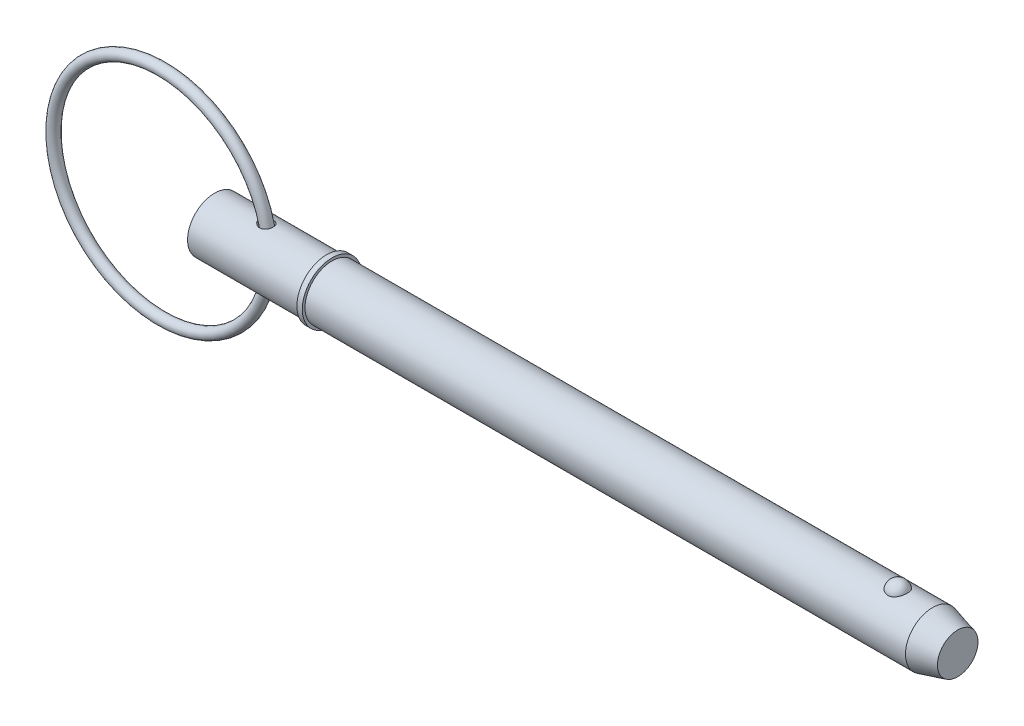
ISO-10303-21;
HEADER;
FILE_DESCRIPTION(('STEP AP214'),'2;1');
FILE_NAME('part.step','',(''),(''),'','','');
FILE_SCHEMA(('AUTOMOTIVE_DESIGN { 1 0 10303 214 1 1 1 1 }'));
ENDSEC;
DATA;
#1=APPLICATION_CONTEXT('core data for automotive mechanical design processes');
#2=APPLICATION_PROTOCOL_DEFINITION('international standard','automotive_design',2000,#1);
#3=PRODUCT_CONTEXT('',#1,'mechanical');
#4=PRODUCT('Part','Part','',(#3));
#5=PRODUCT_RELATED_PRODUCT_CATEGORY('part','',(#4));
#6=PRODUCT_DEFINITION_FORMATION('','',#4);
#7=PRODUCT_DEFINITION_CONTEXT('part definition',#1,'design');
#8=PRODUCT_DEFINITION('design','',#6,#7);
#9=PRODUCT_DEFINITION_SHAPE('','',#8);
#10=(LENGTH_UNIT() NAMED_UNIT(*) SI_UNIT(.MILLI.,.METRE.));
#11=(NAMED_UNIT(*) PLANE_ANGLE_UNIT() SI_UNIT($,.RADIAN.));
#12=(NAMED_UNIT(*) SI_UNIT($,.STERADIAN.) SOLID_ANGLE_UNIT());
#13=UNCERTAINTY_MEASURE_WITH_UNIT(LENGTH_MEASURE(1.E-05),#10,'distance_accuracy_value','');
#14=(GEOMETRIC_REPRESENTATION_CONTEXT(3) GLOBAL_UNCERTAINTY_ASSIGNED_CONTEXT((#13)) GLOBAL_UNIT_ASSIGNED_CONTEXT((#10,
#11,#12)) REPRESENTATION_CONTEXT('',''));
#15=CARTESIAN_POINT('',(0.,0.,0.));
#16=DIRECTION('',(0.,0.,1.));
#17=DIRECTION('',(1.,0.,0.));
#18=AXIS2_PLACEMENT_3D('',#15,#16,#17);
#19=CARTESIAN_POINT('',(-10.8860601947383,0.,0.));
#20=DIRECTION('',(0.,0.,1.));
#21=DIRECTION('',(1.,0.,0.));
#22=AXIS2_PLACEMENT_3D('',#19,#20,#21);
#23=TOROIDAL_SURFACE('',#22,22.225,1.111);
#24=CARTESIAN_POINT('',(12.4499398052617,0.,0.));
#25=VERTEX_POINT('',#24);
#26=VERTEX_LOOP('',#25);
#27=FACE_BOUND('',#26,.T.);
#28=ADVANCED_FACE('P0_F12',(#27),#23,.T.);
#29=CLOSED_SHELL('',(#28));
#30=MANIFOLD_SOLID_BREP('P0_B1',#29);
#31=CARTESIAN_POINT('',(0.,0.,0.));
#32=DIRECTION('',(1.,0.,0.));
#33=DIRECTION('',(0.,0.,-1.));
#34=AXIS2_PLACEMENT_3D('',#31,#32,#33);
#35=CYLINDRICAL_SURFACE('',#34,5.555);
#36=CARTESIAN_POINT('',(9.73108588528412,5.4531967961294,-1.05861687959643));
#37=CARTESIAN_POINT('',(9.79852417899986,5.4428857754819,-1.11173367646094));
#38=CARTESIAN_POINT('',(9.8705426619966,5.43287373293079,-1.15917228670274));
#39=CARTESIAN_POINT('',(10.0216706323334,5.41463354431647,-1.24159548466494));
#40=CARTESIAN_POINT('',(10.100788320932,5.40640749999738,-1.27656543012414));
#41=CARTESIAN_POINT('',(10.2640671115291,5.39277501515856,-1.33298568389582));
#42=CARTESIAN_POINT('',(10.3482338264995,5.38737178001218,-1.35442062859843));
#43=CARTESIAN_POINT('',(10.5191189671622,5.38018930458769,-1.38268153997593));
#44=CARTESIAN_POINT('',(10.6058357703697,5.37840780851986,-1.38951660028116));
#45=CARTESIAN_POINT('',(10.7759121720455,5.37883071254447,-1.38787777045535));
#46=CARTESIAN_POINT('',(10.8592768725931,5.38088957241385,-1.37996287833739));
#47=CARTESIAN_POINT('',(11.0231742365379,5.38856355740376,-1.34968531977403));
#48=CARTESIAN_POINT('',(11.1037078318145,5.39417750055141,-1.3273274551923));
#49=CARTESIAN_POINT('',(11.2542656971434,5.40784427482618,-1.27044672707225));
#50=CARTESIAN_POINT('',(11.3246325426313,5.41571997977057,-1.23678468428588));
#51=CARTESIAN_POINT('',(11.4584043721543,5.43310849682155,-1.15800564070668));
#52=CARTESIAN_POINT('',(11.5218100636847,5.44262114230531,-1.11288980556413));
#53=CARTESIAN_POINT('',(11.6387006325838,5.4619946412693,-1.01348173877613));
#54=CARTESIAN_POINT('',(11.6923567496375,5.47184490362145,-0.959388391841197));
#55=CARTESIAN_POINT('',(11.7899079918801,5.49098914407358,-0.842935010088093));
#56=CARTESIAN_POINT('',(11.8338027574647,5.5002831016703,-0.780574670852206));
#57=CARTESIAN_POINT('',(11.9111930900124,5.51740919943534,-0.648605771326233));
#58=CARTESIAN_POINT('',(11.944571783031,5.52522454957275,-0.578926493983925));
#59=CARTESIAN_POINT('',(11.9994972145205,5.5384271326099,-0.434834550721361));
#60=CARTESIAN_POINT('',(12.0210434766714,5.54381426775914,-0.360421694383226));
#61=CARTESIAN_POINT('',(12.0519313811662,5.55161917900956,-0.208311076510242));
#62=CARTESIAN_POINT('',(12.0611710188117,5.55401212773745,-0.130591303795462));
#63=CARTESIAN_POINT('',(12.0668974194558,5.55548938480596,0.025348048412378));
#64=CARTESIAN_POINT('',(12.0633840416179,5.55457365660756,0.103567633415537));
#65=CARTESIAN_POINT('',(12.0436796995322,5.54953010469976,0.258343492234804));
#66=CARTESIAN_POINT('',(12.0274798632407,5.54540003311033,0.334898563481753));
#67=CARTESIAN_POINT('',(11.9827711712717,5.53437033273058,0.484118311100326));
#68=CARTESIAN_POINT('',(11.9542620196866,5.52747063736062,0.556782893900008));
#69=CARTESIAN_POINT('',(11.8856108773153,5.51165296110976,0.696153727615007));
#70=CARTESIAN_POINT('',(11.8454690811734,5.50273501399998,0.762860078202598));
#71=CARTESIAN_POINT('',(11.7545317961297,5.48386724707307,0.888403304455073));
#72=CARTESIAN_POINT('',(11.7037367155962,5.47391746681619,0.94724048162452));
#73=CARTESIAN_POINT('',(11.5931044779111,5.45416351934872,1.05504470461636));
#74=CARTESIAN_POINT('',(11.533318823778,5.44435885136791,1.10406448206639));
#75=CARTESIAN_POINT('',(11.4061321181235,5.42595363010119,1.19123649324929));
#76=CARTESIAN_POINT('',(11.3387321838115,5.41735290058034,1.22939031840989));
#77=CARTESIAN_POINT('',(11.1991395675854,5.4024225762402,1.29341737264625));
#78=CARTESIAN_POINT('',(11.1270175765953,5.3960658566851,1.3194385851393));
#79=CARTESIAN_POINT('',(10.979323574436,5.38614405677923,1.35937634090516));
#80=CARTESIAN_POINT('',(10.9037515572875,5.38257898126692,1.37329286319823));
#81=CARTESIAN_POINT('',(10.7507722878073,5.37854282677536,1.38901730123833));
#82=CARTESIAN_POINT('',(10.6733560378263,5.37809300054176,1.39074204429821));
#83=CARTESIAN_POINT('',(10.5192388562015,5.38029043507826,1.38221411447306));
#84=CARTESIAN_POINT('',(10.4425381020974,5.38293844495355,1.37195854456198));
#85=CARTESIAN_POINT('',(10.2878936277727,5.39116673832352,1.33926960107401));
#86=CARTESIAN_POINT('',(10.2100819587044,5.3968880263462,1.31624874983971));
#87=CARTESIAN_POINT('',(10.0591420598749,5.4106466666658,1.25849276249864));
#88=CARTESIAN_POINT('',(9.98601576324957,5.41868496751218,1.22375282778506));
#89=CARTESIAN_POINT('',(9.84175565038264,5.43675805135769,1.14087469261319));
#90=CARTESIAN_POINT('',(9.77103801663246,5.44688674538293,1.09202994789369));
#91=CARTESIAN_POINT('',(9.63888287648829,5.46759592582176,0.983100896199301));
#92=CARTESIAN_POINT('',(9.57744762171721,5.47817652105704,0.923013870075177));
#93=CARTESIAN_POINT('',(9.4662044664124,5.49850106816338,0.792984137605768));
#94=CARTESIAN_POINT('',(9.4163677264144,5.5082470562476,0.723066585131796));
#95=CARTESIAN_POINT('',(9.33050546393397,5.52566389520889,0.574973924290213));
#96=CARTESIAN_POINT('',(9.29446727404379,5.53333664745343,0.496806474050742));
#97=CARTESIAN_POINT('',(9.24109888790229,5.54491199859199,0.342579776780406));
#98=CARTESIAN_POINT('',(9.22228936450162,5.54910883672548,0.26705568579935));
#99=CARTESIAN_POINT('',(9.19883437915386,5.55436306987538,0.113748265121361));
#100=CARTESIAN_POINT('',(9.19417820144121,5.55542284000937,0.0359666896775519));
#101=CARTESIAN_POINT('',(9.19905385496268,5.55432298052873,-0.111477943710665));
#102=CARTESIAN_POINT('',(9.20724428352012,5.55246769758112,-0.181191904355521));
#103=CARTESIAN_POINT('',(9.23493000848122,5.54630180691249,-0.318223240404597));
#104=CARTESIAN_POINT('',(9.25442702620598,5.54199082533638,-0.385540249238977));
#105=CARTESIAN_POINT('',(9.30387481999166,5.5313474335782,-0.516280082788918));
#106=CARTESIAN_POINT('',(9.33386163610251,5.52500806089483,-0.579688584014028));
#107=CARTESIAN_POINT('',(9.40305503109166,5.51092599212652,-0.701037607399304));
#108=CARTESIAN_POINT('',(9.44225922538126,5.50318365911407,-0.758979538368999));
#109=CARTESIAN_POINT('',(9.52133732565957,5.48833949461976,-0.859230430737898));
#110=CARTESIAN_POINT('',(9.55998996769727,5.48134889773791,-0.902529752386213));
#111=CARTESIAN_POINT('',(9.64209346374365,5.46725903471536,-0.984288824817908));
#112=CARTESIAN_POINT('',(9.68554534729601,5.46015974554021,-1.02274753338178));
#113=CARTESIAN_POINT('',(9.73108588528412,5.4531967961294,-1.05861687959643));
#114=B_SPLINE_CURVE_WITH_KNOTS('',3,(#36,#37,#38,#39,#40,#41,#42,#43,#44,#45,#46,#47,#48,#49,
#50,#51,#52,#53,#54,#55,#56,#57,#58,#59,#60,#61,#62,#63,#64,#65,#66,#67,#68,#69,#70,#71,#72,#73,
#74,#75,#76,#77,#78,#79,#80,#81,#82,#83,#84,#85,#86,#87,#88,#89,#90,#91,#92,#93,#94,#95,#96,#97,
#98,#99,#100,#101,#102,#103,#104,#105,#106,#107,#108,#109,#110,#111,#112,#113),.UNSPECIFIED.,
.T.,.F.,(4,2,2,2,2,2,2,2,2,2,2,2,2,2,2,2,2,2,2,2,2,2,2,2,2,2,2,2,2,2,2,2,2,2,2,2,2,2,4),(0.,
0.259176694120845,0.518656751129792,0.778430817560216,1.03804303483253,1.28801585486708,
1.53790560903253,1.77195750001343,2.00598558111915,2.23539047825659,2.4648038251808,
2.69668356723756,2.9285726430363,3.16237203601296,3.39617401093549,3.63013963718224,
3.86411088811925,4.09807822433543,4.33203659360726,4.56470246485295,4.79733424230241,
5.02704913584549,5.25676442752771,5.48804534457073,5.71938220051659,5.96237360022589,
6.20546461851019,6.46387943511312,6.72235683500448,6.98018450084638,7.23777490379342,
7.4702968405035,7.70264268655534,7.91229396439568,8.12197716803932,8.33238797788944,
8.54274441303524,8.71772674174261,8.89274668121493),.UNSPECIFIED.);
#115=CARTESIAN_POINT('',(9.73108588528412,5.4531967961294,-1.05861687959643));
#116=VERTEX_POINT('',#115);
#117=EDGE_CURVE('P1_E42',#116,#116,#114,.T.);
#118=ORIENTED_EDGE('',*,*,#117,.T.);
#119=EDGE_LOOP('',(#118));
#120=FACE_BOUND('',#119,.T.);
#121=CARTESIAN_POINT('',(0.,0.,0.));
#122=DIRECTION('',(1.,0.,0.));
#123=DIRECTION('',(0.,0.,-1.));
#124=AXIS2_PLACEMENT_3D('',#121,#122,#123);
#125=CIRCLE('',#124,5.555);
#126=CARTESIAN_POINT('',(0.,0.,-5.555));
#127=VERTEX_POINT('',#126);
#128=EDGE_CURVE('P1_E9',#127,#127,#125,.T.);
#129=ORIENTED_EDGE('',*,*,#128,.T.);
#130=EDGE_LOOP('',(#129));
#131=FACE_BOUND('',#130,.T.);
#132=CARTESIAN_POINT('',(23.019,0.,0.));
#133=DIRECTION('',(1.,0.,0.));
#134=DIRECTION('',(0.,0.,-1.));
#135=AXIS2_PLACEMENT_3D('',#132,#133,#134);
#136=CIRCLE('',#135,5.555);
#137=CARTESIAN_POINT('',(23.019,0.,-5.555));
#138=VERTEX_POINT('',#137);
#139=EDGE_CURVE('P1_E25',#138,#138,#136,.T.);
#140=ORIENTED_EDGE('',*,*,#139,.F.);
#141=EDGE_LOOP('',(#140));
#142=FACE_BOUND('',#141,.T.);
#143=CARTESIAN_POINT('',(9.73108588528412,-5.4531967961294,-1.05861687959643));
#144=CARTESIAN_POINT('',(9.66821110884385,-5.46281068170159,-1.00909184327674));
#145=CARTESIAN_POINT('',(9.60927221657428,-5.47269103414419,-0.954597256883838));
#146=CARTESIAN_POINT('',(9.50103698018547,-5.49196271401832,-0.836622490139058));
#147=CARTESIAN_POINT('',(9.45174193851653,-5.50135397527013,-0.773141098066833));
#148=CARTESIAN_POINT('',(9.36449982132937,-5.51864538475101,-0.638139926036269));
#149=CARTESIAN_POINT('',(9.32660692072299,-5.52653835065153,-0.566583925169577));
#150=CARTESIAN_POINT('',(9.26443740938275,-5.53978685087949,-0.417563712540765));
#151=CARTESIAN_POINT('',(9.24015003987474,-5.54514438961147,-0.34010422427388));
#152=CARTESIAN_POINT('',(9.20806696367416,-5.55228040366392,-0.188389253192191));
#153=CARTESIAN_POINT('',(9.19907227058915,-5.55431849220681,-0.114399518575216));
#154=CARTESIAN_POINT('',(9.19432225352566,-5.55539069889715,0.0340148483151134));
#155=CARTESIAN_POINT('',(9.19856204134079,-5.55442592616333,0.108439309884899));
#156=CARTESIAN_POINT('',(9.21926816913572,-5.54978420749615,0.250226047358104));
#157=CARTESIAN_POINT('',(9.2348766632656,-5.54629766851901,0.31772275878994));
#158=CARTESIAN_POINT('',(9.27656619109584,-5.53719805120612,0.449233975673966));
#159=CARTESIAN_POINT('',(9.3026486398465,-5.53158468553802,0.513248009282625));
#160=CARTESIAN_POINT('',(9.36540111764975,-5.51852259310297,0.63880901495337));
#161=CARTESIAN_POINT('',(9.40244578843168,-5.51101059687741,0.700161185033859));
#162=CARTESIAN_POINT('',(9.48531033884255,-5.49498546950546,0.816463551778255));
#163=CARTESIAN_POINT('',(9.5311337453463,-5.48647193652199,0.871411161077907));
#164=CARTESIAN_POINT('',(9.63549825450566,-5.46826315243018,0.979510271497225));
#165=CARTESIAN_POINT('',(9.69487291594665,-5.4585383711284,1.03185240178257));
#166=CARTESIAN_POINT('',(9.82107706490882,-5.43973797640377,1.12677509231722));
#167=CARTESIAN_POINT('',(9.8879103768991,-5.43066269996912,1.16935061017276));
#168=CARTESIAN_POINT('',(10.033391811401,-5.41336505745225,1.24708757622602));
#169=CARTESIAN_POINT('',(10.1125613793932,-5.40528106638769,1.28130933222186));
#170=CARTESIAN_POINT('',(10.2757060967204,-5.39196874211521,1.3362270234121));
#171=CARTESIAN_POINT('',(10.3596813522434,-5.38674047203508,1.35692265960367));
#172=CARTESIAN_POINT('',(10.5297702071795,-5.37991196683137,1.38375156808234));
#173=CARTESIAN_POINT('',(10.6158742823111,-5.37829778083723,1.38994084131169));
#174=CARTESIAN_POINT('',(10.7878226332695,-5.37901070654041,1.38718250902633));
#175=CARTESIAN_POINT('',(10.8736670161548,-5.38133587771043,1.37824235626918));
#176=CARTESIAN_POINT('',(11.0366214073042,-5.38945418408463,1.34612618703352));
#177=CARTESIAN_POINT('',(11.1139351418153,-5.39501006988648,1.32392147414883));
#178=CARTESIAN_POINT('',(11.2633246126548,-5.40877222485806,1.26652021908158));
#179=CARTESIAN_POINT('',(11.3354015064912,-5.41697790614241,1.23132655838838));
#180=CARTESIAN_POINT('',(11.4690899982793,-5.43466078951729,1.15069817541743));
#181=CARTESIAN_POINT('',(11.5310200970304,-5.4440673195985,1.10577441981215));
#182=CARTESIAN_POINT('',(11.6463540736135,-5.46335537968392,1.0061512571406));
#183=CARTESIAN_POINT('',(11.6997580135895,-5.47323690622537,0.951451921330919));
#184=CARTESIAN_POINT('',(11.7967319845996,-5.49239864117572,0.833747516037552));
#185=CARTESIAN_POINT('',(11.8402908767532,-5.50167816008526,0.770733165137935));
#186=CARTESIAN_POINT('',(11.9164538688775,-5.518621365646,0.638202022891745));
#187=CARTESIAN_POINT('',(11.9490573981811,-5.52628496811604,0.568684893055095));
#188=CARTESIAN_POINT('',(12.0028717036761,-5.53925911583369,0.424207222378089));
#189=CARTESIAN_POINT('',(12.023941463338,-5.54454040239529,0.349191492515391));
#190=CARTESIAN_POINT('',(12.053591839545,-5.55204602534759,0.196582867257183));
#191=CARTESIAN_POINT('',(12.0621722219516,-5.55427030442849,0.118989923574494));
#192=CARTESIAN_POINT('',(12.0666512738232,-5.55542602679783,-0.0368468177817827));
#193=CARTESIAN_POINT('',(12.0625074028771,-5.55434642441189,-0.11509192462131));
#194=CARTESIAN_POINT('',(12.0415418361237,-5.54898613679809,-0.269753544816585));
#195=CARTESIAN_POINT('',(12.0247199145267,-5.54470539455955,-0.346170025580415));
#196=CARTESIAN_POINT('',(11.9787920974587,-5.53340452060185,-0.495008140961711));
#197=CARTESIAN_POINT('',(11.9496857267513,-5.52638428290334,-0.56742962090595));
#198=CARTESIAN_POINT('',(11.8798787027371,-5.51036911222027,-0.706216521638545));
#199=CARTESIAN_POINT('',(11.8391779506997,-5.50137416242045,-0.772581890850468));
#200=CARTESIAN_POINT('',(11.7472553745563,-5.48242167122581,-0.897247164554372));
#201=CARTESIAN_POINT('',(11.6960515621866,-5.47246579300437,-0.955560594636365));
#202=CARTESIAN_POINT('',(11.5843994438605,-5.45270071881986,-1.06256643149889));
#203=CARTESIAN_POINT('',(11.5239521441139,-5.44289150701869,-1.11125988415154));
#204=CARTESIAN_POINT('',(11.396157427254,-5.42463941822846,-1.19717500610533));
#205=CARTESIAN_POINT('',(11.3288903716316,-5.41618309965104,-1.23451335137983));
#206=CARTESIAN_POINT('',(11.1888557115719,-5.40145691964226,-1.29743539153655));
#207=CARTESIAN_POINT('',(11.1160887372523,-5.39518680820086,-1.32302043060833));
#208=CARTESIAN_POINT('',(10.9677009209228,-5.38553131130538,-1.36179181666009));
#209=CARTESIAN_POINT('',(10.8921036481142,-5.38212602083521,-1.3750637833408));
#210=CARTESIAN_POINT('',(10.7396925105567,-5.37842027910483,-1.38948741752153));
#211=CARTESIAN_POINT('',(10.6628784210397,-5.37812040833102,-1.39063681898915));
#212=CARTESIAN_POINT('',(10.5077947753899,-5.38059635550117,-1.38102577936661));
#213=CARTESIAN_POINT('',(10.4295489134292,-5.3834629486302,-1.36991384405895));
#214=CARTESIAN_POINT('',(10.2758428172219,-5.3920092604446,-1.33587599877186));
#215=CARTESIAN_POINT('',(10.2003829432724,-5.39768934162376,-1.31294856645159));
#216=CARTESIAN_POINT('',(10.0559381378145,-5.4110281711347,-1.25682313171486));
#217=CARTESIAN_POINT('',(9.98683368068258,-5.41862962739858,-1.22391777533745));
#218=CARTESIAN_POINT('',(9.85432617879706,-5.43513913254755,-1.14838146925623));
#219=CARTESIAN_POINT('',(9.79092361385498,-5.44404729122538,-1.1057497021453));
#220=CARTESIAN_POINT('',(9.73108588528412,-5.4531967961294,-1.05861687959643));
#221=B_SPLINE_CURVE_WITH_KNOTS('',3,(#143,#144,#145,#146,#147,#148,#149,#150,#151,#152,#153,
#154,#155,#156,#157,#158,#159,#160,#161,#162,#163,#164,#165,#166,#167,#168,#169,#170,#171,#172,
#173,#174,#175,#176,#177,#178,#179,#180,#181,#182,#183,#184,#185,#186,#187,#188,#189,#190,#191,
#192,#193,#194,#195,#196,#197,#198,#199,#200,#201,#202,#203,#204,#205,#206,#207,#208,#209,#210,
#211,#212,#213,#214,#215,#216,#217,#218,#219,#220),.UNSPECIFIED.,.T.,.F.,(4,2,2,2,2,2,2,2,2,2,2,
2,2,2,2,2,2,2,2,2,2,2,2,2,2,2,2,2,2,2,2,2,2,2,2,2,2,2,4),(0.,0.241596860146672,
0.483226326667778,0.725986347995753,0.968554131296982,1.19103755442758,1.41343881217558,
1.62059806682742,1.82778531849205,2.04308674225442,2.25847484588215,2.4967195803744,
2.73508704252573,2.99374644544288,3.25241156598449,3.51007646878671,3.76761448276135,
4.00827541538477,4.24888299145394,4.47904430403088,4.70920393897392,4.93962269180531,
5.17005344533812,5.4032419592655,5.63643484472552,5.87040820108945,6.10438572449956,
6.33837230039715,6.57236086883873,6.80595147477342,7.03951667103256,7.27059385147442,
7.50164459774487,7.73107640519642,7.96055109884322,8.19677907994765,8.43303750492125,
8.66294515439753,8.89287213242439),.UNSPECIFIED.);
#222=CARTESIAN_POINT('',(9.73108588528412,-5.4531967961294,-1.05861687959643));
#223=VERTEX_POINT('',#222);
#224=EDGE_CURVE('P1_E17',#223,#223,#221,.T.);
#225=ORIENTED_EDGE('',*,*,#224,.T.);
#226=EDGE_LOOP('',(#225));
#227=FACE_BOUND('',#226,.T.);
#228=ADVANCED_FACE('P1_F13',(#120,#131,#142,#227),#35,.T.);
#229=CARTESIAN_POINT('',(0.,0.,0.));
#230=DIRECTION('',(1.,0.,0.));
#231=DIRECTION('',(0.,0.,-1.));
#232=AXIS2_PLACEMENT_3D('',#229,#230,#231);
#233=CYLINDRICAL_SURFACE('',#232,5.555);
#234=CARTESIAN_POINT('',(147.517114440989,0.,0.));
#235=DIRECTION('',(1.,0.,0.));
#236=DIRECTION('',(0.,0.,-1.));
#237=AXIS2_PLACEMENT_3D('',#234,#235,#236);
#238=CIRCLE('',#237,5.555);
#239=CARTESIAN_POINT('',(147.517114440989,0.,-5.555));
#240=VERTEX_POINT('',#239);
#241=EDGE_CURVE('P1_E99',#240,#240,#238,.T.);
#242=ORIENTED_EDGE('',*,*,#241,.F.);
#243=EDGE_LOOP('',(#242));
#244=FACE_BOUND('',#243,.T.);
#245=CARTESIAN_POINT('',(24.13,0.,0.));
#246=DIRECTION('',(1.,0.,0.));
#247=DIRECTION('',(0.,0.,-1.));
#248=AXIS2_PLACEMENT_3D('',#245,#246,#247);
#249=CIRCLE('',#248,5.555);
#250=CARTESIAN_POINT('',(24.13,0.,-5.555));
#251=VERTEX_POINT('',#250);
#252=EDGE_CURVE('P1_E96',#251,#251,#249,.T.);
#253=ORIENTED_EDGE('',*,*,#252,.T.);
#254=EDGE_LOOP('',(#253));
#255=FACE_BOUND('',#254,.T.);
#256=CARTESIAN_POINT('',(140.398626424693,5.16741224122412,2.03859650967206));
#257=CARTESIAN_POINT('',(140.292949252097,5.16740893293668,2.03859990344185));
#258=CARTESIAN_POINT('',(140.18729894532,5.17079470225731,2.03008306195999));
#259=CARTESIAN_POINT('',(139.979141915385,5.18392795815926,1.99630721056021));
#260=CARTESIAN_POINT('',(139.876634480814,5.19367399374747,1.97105201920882));
#261=CARTESIAN_POINT('',(139.677771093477,5.21839168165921,1.90463997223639));
#262=CARTESIAN_POINT('',(139.581406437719,5.23335573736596,1.8635062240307));
#263=CARTESIAN_POINT('',(139.397080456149,5.26688076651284,1.76652592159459));
#264=CARTESIAN_POINT('',(139.309120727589,5.28544242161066,1.71067657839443));
#265=CARTESIAN_POINT('',(139.141265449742,5.32479845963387,1.58399959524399));
#266=CARTESIAN_POINT('',(139.06166564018,5.34564089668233,1.51279545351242));
#267=CARTESIAN_POINT('',(138.91512901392,5.38697258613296,1.35828584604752));
#268=CARTESIAN_POINT('',(138.848194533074,5.40746177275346,1.27497815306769));
#269=CARTESIAN_POINT('',(138.72561039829,5.44694508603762,1.0944029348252));
#270=CARTESIAN_POINT('',(138.670598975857,5.46583143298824,0.996677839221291));
#271=CARTESIAN_POINT('',(138.576937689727,5.49908030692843,0.792961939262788));
#272=CARTESIAN_POINT('',(138.538289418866,5.513442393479,0.686970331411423));
#273=CARTESIAN_POINT('',(138.477680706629,5.53635851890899,0.468019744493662));
#274=CARTESIAN_POINT('',(138.455972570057,5.54482455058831,0.354981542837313));
#275=CARTESIAN_POINT('',(138.430636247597,5.55473324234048,0.126595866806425));
#276=CARTESIAN_POINT('',(138.427007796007,5.55617600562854,0.0112484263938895));
#277=CARTESIAN_POINT('',(138.437881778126,5.55189984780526,-0.218011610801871));
#278=CARTESIAN_POINT('',(138.452315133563,5.54620821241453,-0.331928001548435));
#279=CARTESIAN_POINT('',(138.498903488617,5.52828920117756,-0.555544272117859));
#280=CARTESIAN_POINT('',(138.531058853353,5.5160616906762,-0.665244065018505));
#281=CARTESIAN_POINT('',(138.612488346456,5.48630779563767,-0.877469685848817));
#282=CARTESIAN_POINT('',(138.661781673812,5.4687754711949,-0.979987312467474));
#283=CARTESIAN_POINT('',(138.776478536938,5.43024700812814,-1.1748697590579));
#284=CARTESIAN_POINT('',(138.841883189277,5.4092506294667,-1.26723387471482));
#285=CARTESIAN_POINT('',(138.987571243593,5.36600927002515,-1.4394013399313));
#286=CARTESIAN_POINT('',(139.067885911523,5.34376173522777,-1.51917763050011));
#287=CARTESIAN_POINT('',(139.241452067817,5.30057971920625,-1.66360338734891));
#288=CARTESIAN_POINT('',(139.334702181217,5.27964509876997,-1.72825445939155));
#289=CARTESIAN_POINT('',(139.529393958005,5.24205250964,-1.83909478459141));
#290=CARTESIAN_POINT('',(139.630590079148,5.22530519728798,-1.88568407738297));
#291=CARTESIAN_POINT('',(139.840155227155,5.19750919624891,-1.96100802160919));
#292=CARTESIAN_POINT('',(139.948521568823,5.1864583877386,-1.98974931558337));
#293=CARTESIAN_POINT('',(140.163498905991,5.17184410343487,-2.02742262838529));
#294=CARTESIAN_POINT('',(140.269925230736,5.1679328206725,-2.03727608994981));
#295=CARTESIAN_POINT('',(140.482992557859,5.16698995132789,-2.03966777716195));
#296=CARTESIAN_POINT('',(140.589633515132,5.16995704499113,-2.0322093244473));
#297=CARTESIAN_POINT('',(140.796773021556,5.18222383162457,-2.00071170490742));
#298=CARTESIAN_POINT('',(140.897359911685,5.19133213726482,-1.97717337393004));
#299=CARTESIAN_POINT('',(141.093014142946,5.21467637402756,-1.91475248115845));
#300=CARTESIAN_POINT('',(141.188081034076,5.22891272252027,-1.87586867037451));
#301=CARTESIAN_POINT('',(141.372371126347,5.26137066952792,-1.78282713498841));
#302=CARTESIAN_POINT('',(141.461419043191,5.27967329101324,-1.72835124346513));
#303=CARTESIAN_POINT('',(141.629288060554,5.3181741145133,-1.60597483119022));
#304=CARTESIAN_POINT('',(141.708106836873,5.33837274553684,-1.5380712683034));
#305=CARTESIAN_POINT('',(141.857515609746,5.37968287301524,-1.38688970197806));
#306=CARTESIAN_POINT('',(141.927505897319,5.40079011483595,-1.3030174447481));
#307=CARTESIAN_POINT('',(142.053012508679,5.44074401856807,-1.12458170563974));
#308=CARTESIAN_POINT('',(142.108526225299,5.45959027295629,-1.03001630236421));
#309=CARTESIAN_POINT('',(142.205550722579,5.49369849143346,-0.829439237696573));
#310=CARTESIAN_POINT('',(142.246548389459,5.50882422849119,-0.723155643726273));
#311=CARTESIAN_POINT('',(142.311125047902,5.53310911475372,-0.50477271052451));
#312=CARTESIAN_POINT('',(142.334703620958,5.54226812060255,-0.392673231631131));
#313=CARTESIAN_POINT('',(142.364013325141,5.55370358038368,-0.165459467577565));
#314=CARTESIAN_POINT('',(142.369688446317,5.55595843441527,-0.0503368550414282));
#315=CARTESIAN_POINT('',(142.362916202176,5.55329317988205,0.179288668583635));
#316=CARTESIAN_POINT('',(142.350469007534,5.54837313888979,0.293791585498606));
#317=CARTESIAN_POINT('',(142.307779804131,5.53189037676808,0.518526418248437));
#318=CARTESIAN_POINT('',(142.277598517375,5.5203503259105,0.628771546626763));
#319=CARTESIAN_POINT('',(142.200096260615,5.49182453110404,0.842318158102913));
#320=CARTESIAN_POINT('',(142.152774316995,5.47483847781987,0.945619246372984));
#321=CARTESIAN_POINT('',(142.041720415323,5.43710633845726,1.14281571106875));
#322=CARTESIAN_POINT('',(141.977921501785,5.41634501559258,1.23667048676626));
#323=CARTESIAN_POINT('',(141.835357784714,5.37334572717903,1.41185243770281));
#324=CARTESIAN_POINT('',(141.75659323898,5.35110778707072,1.49317982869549));
#325=CARTESIAN_POINT('',(141.586423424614,5.30779474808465,1.64049162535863));
#326=CARTESIAN_POINT('',(141.49510026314,5.28671324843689,1.7065687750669));
#327=CARTESIAN_POINT('',(141.301739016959,5.2480485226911,1.82201372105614));
#328=CARTESIAN_POINT('',(141.199700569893,5.23046541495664,1.87138095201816));
#329=CARTESIAN_POINT('',(140.983618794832,5.20042692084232,1.95335298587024));
#330=CARTESIAN_POINT('',(140.869260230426,5.18820192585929,1.98521734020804));
#331=CARTESIAN_POINT('',(140.636130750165,5.17169804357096,2.02783294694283));
#332=CARTESIAN_POINT('',(140.517361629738,5.16741595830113,2.03859269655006));
#333=CARTESIAN_POINT('',(140.398626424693,5.16741224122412,2.03859650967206));
#334=B_SPLINE_CURVE_WITH_KNOTS('',3,(#256,#257,#258,#259,#260,#261,#262,#263,#264,#265,#266,
#267,#268,#269,#270,#271,#272,#273,#274,#275,#276,#277,#278,#279,#280,#281,#282,#283,#284,#285,
#286,#287,#288,#289,#290,#291,#292,#293,#294,#295,#296,#297,#298,#299,#300,#301,#302,#303,#304,
#305,#306,#307,#308,#309,#310,#311,#312,#313,#314,#315,#316,#317,#318,#319,#320,#321,#322,#323,
#324,#325,#326,#327,#328,#329,#330,#331,#332,#333),.UNSPECIFIED.,.T.,.F.,(4,2,2,2,2,2,2,2,2,2,2,
2,2,2,2,2,2,2,2,2,2,2,2,2,2,2,2,2,2,2,2,2,2,2,2,2,2,2,4),(0.,0.316595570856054,
0.633118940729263,0.949183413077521,1.26530783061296,1.59030762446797,1.91536729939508,
2.25495824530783,2.59458224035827,2.93917283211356,3.28375835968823,3.62703002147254,
3.97030875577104,4.31397329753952,4.65766166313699,5.00207904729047,5.34645984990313,
5.68270547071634,6.01882587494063,6.33808403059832,6.65728093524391,6.9669637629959,
7.27667180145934,7.59321535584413,7.90983070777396,8.24210387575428,8.57443684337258,
8.91755896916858,9.26068933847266,9.604892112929,9.94909164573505,10.2921194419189,
10.6351667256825,10.9796305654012,11.3240884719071,11.6663928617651,12.0087088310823,
12.3645679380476,12.7202837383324),.UNSPECIFIED.);
#335=CARTESIAN_POINT('',(140.398626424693,5.16741224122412,2.03859650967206));
#336=VERTEX_POINT('',#335);
#337=EDGE_CURVE('P1_E34',#336,#336,#334,.T.);
#338=ORIENTED_EDGE('',*,*,#337,.T.);
#339=EDGE_LOOP('',(#338));
#340=FACE_BOUND('',#339,.T.);
#341=ADVANCED_FACE('P1_F46',(#244,#255,#340),#233,.T.);
#342=CARTESIAN_POINT('',(0.,0.,0.));
#343=DIRECTION('',(-1.,0.,0.));
#344=DIRECTION('',(0.,0.,1.));
#345=AXIS2_PLACEMENT_3D('',#342,#343,#344);
#346=PLANE('',#345);
#347=ORIENTED_EDGE('',*,*,#128,.F.);
#348=EDGE_LOOP('',(#347));
#349=FACE_BOUND('',#348,.T.);
#350=ADVANCED_FACE('P1_F15',(#349),#346,.T.);
#351=CARTESIAN_POINT('',(23.019,5.555,0.));
#352=DIRECTION('',(-1.,0.,0.));
#353=DIRECTION('',(0.,0.,1.));
#354=AXIS2_PLACEMENT_3D('',#351,#352,#353);
#355=PLANE('',#354);
#356=ORIENTED_EDGE('',*,*,#139,.T.);
#357=EDGE_LOOP('',(#356));
#358=FACE_BOUND('',#357,.T.);
#359=CARTESIAN_POINT('',(23.019,0.,0.));
#360=DIRECTION('',(1.,0.,0.));
#361=DIRECTION('',(0.,0.,-1.));
#362=AXIS2_PLACEMENT_3D('',#359,#360,#361);
#363=CIRCLE('',#362,6.1105);
#364=CARTESIAN_POINT('',(23.019,0.,-6.1105));
#365=VERTEX_POINT('',#364);
#366=EDGE_CURVE('P1_E30',#365,#365,#363,.T.);
#367=ORIENTED_EDGE('',*,*,#366,.F.);
#368=EDGE_LOOP('',(#367));
#369=FACE_BOUND('',#368,.T.);
#370=ADVANCED_FACE('P1_F81',(#358,#369),#355,.T.);
#371=CARTESIAN_POINT('',(0.,0.,0.));
#372=DIRECTION('',(1.,0.,0.));
#373=DIRECTION('',(0.,0.,-1.));
#374=AXIS2_PLACEMENT_3D('',#371,#372,#373);
#375=CYLINDRICAL_SURFACE('',#374,6.1105);
#376=ORIENTED_EDGE('',*,*,#366,.T.);
#377=EDGE_LOOP('',(#376));
#378=FACE_BOUND('',#377,.T.);
#379=CARTESIAN_POINT('',(24.13,0.,0.));
#380=DIRECTION('',(1.,0.,0.));
#381=DIRECTION('',(0.,0.,-1.));
#382=AXIS2_PLACEMENT_3D('',#379,#380,#381);
#383=CIRCLE('',#382,6.1105);
#384=CARTESIAN_POINT('',(24.13,0.,-6.1105));
#385=VERTEX_POINT('',#384);
#386=EDGE_CURVE('P1_E95',#385,#385,#383,.T.);
#387=ORIENTED_EDGE('',*,*,#386,.F.);
#388=EDGE_LOOP('',(#387));
#389=FACE_BOUND('',#388,.T.);
#390=ADVANCED_FACE('P1_F68',(#378,#389),#375,.T.);
#391=CARTESIAN_POINT('',(24.13,6.1105,0.));
#392=DIRECTION('',(1.,0.,0.));
#393=DIRECTION('',(0.,0.,-1.));
#394=AXIS2_PLACEMENT_3D('',#391,#392,#393);
#395=PLANE('',#394);
#396=ORIENTED_EDGE('',*,*,#386,.T.);
#397=EDGE_LOOP('',(#396));
#398=FACE_BOUND('',#397,.T.);
#399=ORIENTED_EDGE('',*,*,#252,.F.);
#400=EDGE_LOOP('',(#399));
#401=FACE_BOUND('',#400,.T.);
#402=ADVANCED_FACE('P1_F62',(#398,#401),#395,.T.);
#403=CARTESIAN_POINT('',(152.7,0.,0.));
#404=DIRECTION('',(-1.,0.,0.));
#405=DIRECTION('',(0.,0.,1.));
#406=AXIS2_PLACEMENT_3D('',#403,#404,#405);
#407=CONICAL_SURFACE('',#406,4.16625000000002,0.261799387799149);
#408=ORIENTED_EDGE('',*,*,#241,.T.);
#409=EDGE_LOOP('',(#408));
#410=FACE_BOUND('',#409,.T.);
#411=CARTESIAN_POINT('',(152.7,0.,0.));
#412=DIRECTION('',(1.,0.,0.));
#413=DIRECTION('',(0.,0.,-1.));
#414=AXIS2_PLACEMENT_3D('',#411,#412,#413);
#415=CIRCLE('',#414,4.16625000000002);
#416=CARTESIAN_POINT('',(152.7,0.,-4.16625000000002));
#417=VERTEX_POINT('',#416);
#418=EDGE_CURVE('P1_E41',#417,#417,#415,.T.);
#419=ORIENTED_EDGE('',*,*,#418,.F.);
#420=EDGE_LOOP('',(#419));
#421=FACE_BOUND('',#420,.T.);
#422=ADVANCED_FACE('P1_F59',(#410,#421),#407,.T.);
#423=CARTESIAN_POINT('',(152.7,4.16625000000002,0.));
#424=DIRECTION('',(1.,0.,0.));
#425=DIRECTION('',(0.,0.,-1.));
#426=AXIS2_PLACEMENT_3D('',#423,#424,#425);
#427=PLANE('',#426);
#428=ORIENTED_EDGE('',*,*,#418,.T.);
#429=EDGE_LOOP('',(#428));
#430=FACE_BOUND('',#429,.T.);
#431=ADVANCED_FACE('P1_F55',(#430),#427,.T.);
#432=CARTESIAN_POINT('',(140.398626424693,4.99949999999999,0.));
#433=DIRECTION('',(-1.,0.,0.));
#434=DIRECTION('',(0.,1.,0.));
#435=AXIS2_PLACEMENT_3D('',#432,#433,#434);
#436=SPHERICAL_SURFACE('',#435,2.04550000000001);
#437=ORIENTED_EDGE('',*,*,#337,.F.);
#438=EDGE_LOOP('',(#437));
#439=FACE_BOUND('',#438,.T.);
#440=ADVANCED_FACE('P1_F50',(#439),#436,.T.);
#441=CARTESIAN_POINT('',(-10.8860601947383,0.,0.));
#442=DIRECTION('',(0.,0.,1.));
#443=DIRECTION('',(1.,0.,0.));
#444=AXIS2_PLACEMENT_3D('',#441,#442,#443);
#445=TOROIDAL_SURFACE('',#444,22.225,1.38875);
#446=ORIENTED_EDGE('',*,*,#224,.F.);
#447=EDGE_LOOP('',(#446));
#448=FACE_BOUND('',#447,.T.);
#449=ORIENTED_EDGE('',*,*,#117,.F.);
#450=EDGE_LOOP('',(#449));
#451=FACE_BOUND('',#450,.T.);
#452=ADVANCED_FACE('P1_F54',(#448,#451),#445,.F.);
#453=CLOSED_SHELL('',(#228,#341,#350,#370,#390,#402,#422,#431,#440,#452));
#454=MANIFOLD_SOLID_BREP('P1_B1',#453);
#455=ADVANCED_BREP_SHAPE_REPRESENTATION('',(#18,#30,#454),#14);
#456=SHAPE_DEFINITION_REPRESENTATION(#9,#455);
ENDSEC;
END-ISO-10303-21;
